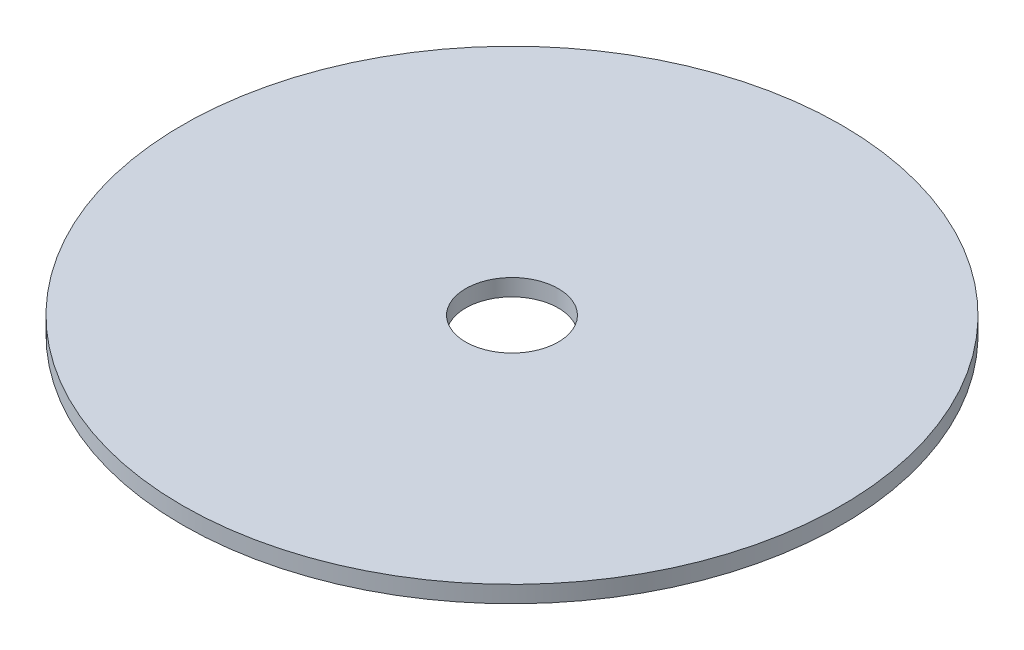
ISO-10303-21;
HEADER;
FILE_DESCRIPTION(('STEP AP214'),'2;1');
FILE_NAME('part.step','',(''),(''),'','','');
FILE_SCHEMA(('AUTOMOTIVE_DESIGN { 1 0 10303 214 1 1 1 1 }'));
ENDSEC;
DATA;
#1=APPLICATION_CONTEXT('core data for automotive mechanical design processes');
#2=APPLICATION_PROTOCOL_DEFINITION('international standard','automotive_design',2000,#1);
#3=PRODUCT_CONTEXT('',#1,'mechanical');
#4=PRODUCT('Part','Part','',(#3));
#5=PRODUCT_RELATED_PRODUCT_CATEGORY('part','',(#4));
#6=PRODUCT_DEFINITION_FORMATION('','',#4);
#7=PRODUCT_DEFINITION_CONTEXT('part definition',#1,'design');
#8=PRODUCT_DEFINITION('design','',#6,#7);
#9=PRODUCT_DEFINITION_SHAPE('','',#8);
#10=(LENGTH_UNIT() NAMED_UNIT(*) SI_UNIT(.MILLI.,.METRE.));
#11=(NAMED_UNIT(*) PLANE_ANGLE_UNIT() SI_UNIT($,.RADIAN.));
#12=(NAMED_UNIT(*) SI_UNIT($,.STERADIAN.) SOLID_ANGLE_UNIT());
#13=UNCERTAINTY_MEASURE_WITH_UNIT(LENGTH_MEASURE(1.E-05),#10,'distance_accuracy_value','');
#14=(GEOMETRIC_REPRESENTATION_CONTEXT(3) GLOBAL_UNCERTAINTY_ASSIGNED_CONTEXT((#13)) GLOBAL_UNIT_ASSIGNED_CONTEXT((#10,
#11,#12)) REPRESENTATION_CONTEXT('',''));
#15=CARTESIAN_POINT('',(0.,0.,0.));
#16=DIRECTION('',(0.,0.,1.));
#17=DIRECTION('',(1.,0.,0.));
#18=AXIS2_PLACEMENT_3D('',#15,#16,#17);
#19=CARTESIAN_POINT('',(0.,1.2954,0.));
#20=DIRECTION('',(0.,1.,0.));
#21=DIRECTION('',(0.,0.,1.));
#22=AXIS2_PLACEMENT_3D('',#19,#20,#21);
#23=PLANE('',#22);
#24=CARTESIAN_POINT('',(0.,1.2954,0.));
#25=DIRECTION('',(0.,1.,0.));
#26=DIRECTION('',(0.,0.,1.));
#27=AXIS2_PLACEMENT_3D('',#24,#25,#26);
#28=CIRCLE('',#27,25.4);
#29=CARTESIAN_POINT('',(0.,1.2954,25.4));
#30=VERTEX_POINT('',#29);
#31=EDGE_CURVE('E10',#30,#30,#28,.T.);
#32=ORIENTED_EDGE('',*,*,#31,.T.);
#33=EDGE_LOOP('',(#32));
#34=FACE_BOUND('',#33,.T.);
#35=CARTESIAN_POINT('',(0.,1.2954,0.));
#36=DIRECTION('',(0.,1.,0.));
#37=DIRECTION('',(0.,0.,1.));
#38=AXIS2_PLACEMENT_3D('',#35,#36,#37);
#39=CIRCLE('',#38,3.5687);
#40=CARTESIAN_POINT('',(0.,1.2954,3.5687));
#41=VERTEX_POINT('',#40);
#42=EDGE_CURVE('E42',#41,#41,#39,.T.);
#43=ORIENTED_EDGE('',*,*,#42,.F.);
#44=EDGE_LOOP('',(#43));
#45=FACE_BOUND('',#44,.T.);
#46=ADVANCED_FACE('F31',(#34,#45),#23,.T.);
#47=CARTESIAN_POINT('',(0.,0.,0.));
#48=DIRECTION('',(0.,1.,0.));
#49=DIRECTION('',(0.,0.,1.));
#50=AXIS2_PLACEMENT_3D('',#47,#48,#49);
#51=PLANE('',#50);
#52=CARTESIAN_POINT('',(0.,0.,0.));
#53=DIRECTION('',(0.,1.,0.));
#54=DIRECTION('',(0.,0.,1.));
#55=AXIS2_PLACEMENT_3D('',#52,#53,#54);
#56=CIRCLE('',#55,25.4);
#57=CARTESIAN_POINT('',(0.,0.,25.4));
#58=VERTEX_POINT('',#57);
#59=EDGE_CURVE('E35',#58,#58,#56,.T.);
#60=ORIENTED_EDGE('',*,*,#59,.F.);
#61=EDGE_LOOP('',(#60));
#62=FACE_BOUND('',#61,.T.);
#63=CARTESIAN_POINT('',(0.,0.,0.));
#64=DIRECTION('',(0.,1.,0.));
#65=DIRECTION('',(0.,0.,1.));
#66=AXIS2_PLACEMENT_3D('',#63,#64,#65);
#67=CIRCLE('',#66,3.5687);
#68=CARTESIAN_POINT('',(0.,0.,3.5687));
#69=VERTEX_POINT('',#68);
#70=EDGE_CURVE('E44',#69,#69,#67,.T.);
#71=ORIENTED_EDGE('',*,*,#70,.T.);
#72=EDGE_LOOP('',(#71));
#73=FACE_BOUND('',#72,.T.);
#74=ADVANCED_FACE('F54',(#62,#73),#51,.F.);
#75=CARTESIAN_POINT('',(0.,1.2954,0.));
#76=DIRECTION('',(0.,-1.,0.));
#77=DIRECTION('',(0.,0.,-1.));
#78=AXIS2_PLACEMENT_3D('',#75,#76,#77);
#79=CYLINDRICAL_SURFACE('',#78,25.4);
#80=ORIENTED_EDGE('',*,*,#31,.F.);
#81=EDGE_LOOP('',(#80));
#82=FACE_BOUND('',#81,.T.);
#83=ORIENTED_EDGE('',*,*,#59,.T.);
#84=EDGE_LOOP('',(#83));
#85=FACE_BOUND('',#84,.T.);
#86=ADVANCED_FACE('F33',(#82,#85),#79,.T.);
#87=CARTESIAN_POINT('',(0.,1.2954,0.));
#88=DIRECTION('',(0.,-1.,0.));
#89=DIRECTION('',(0.,0.,-1.));
#90=AXIS2_PLACEMENT_3D('',#87,#88,#89);
#91=CYLINDRICAL_SURFACE('',#90,3.5687);
#92=ORIENTED_EDGE('',*,*,#42,.T.);
#93=EDGE_LOOP('',(#92));
#94=FACE_BOUND('',#93,.T.);
#95=ORIENTED_EDGE('',*,*,#70,.F.);
#96=EDGE_LOOP('',(#95));
#97=FACE_BOUND('',#96,.T.);
#98=ADVANCED_FACE('F50',(#94,#97),#91,.F.);
#99=CLOSED_SHELL('',(#46,#74,#86,#98));
#100=MANIFOLD_SOLID_BREP('B2',#99);
#101=ADVANCED_BREP_SHAPE_REPRESENTATION('',(#18,#100),#14);
#102=SHAPE_DEFINITION_REPRESENTATION(#9,#101);
ENDSEC;
END-ISO-10303-21;
